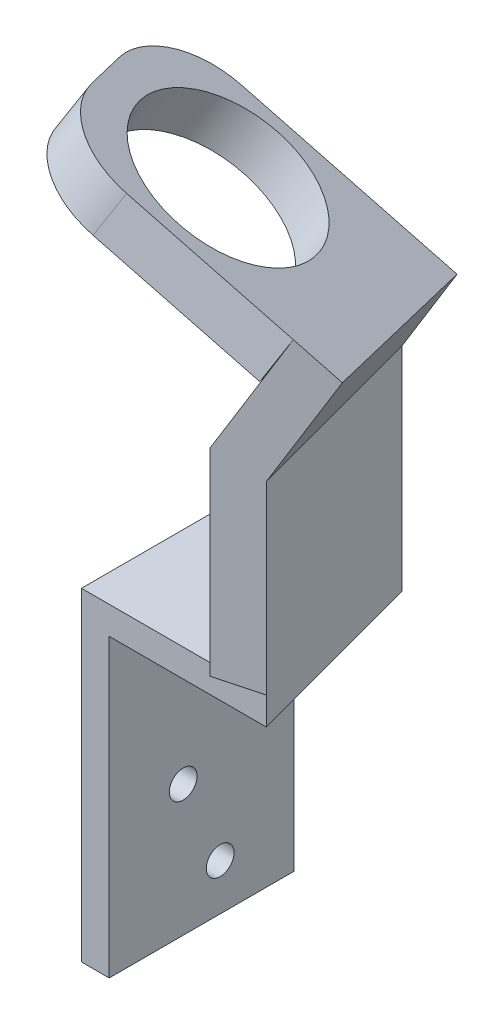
from build123d import *

# Parameters (mm, degrees)
EXTRUDE_3_DEPTH     = 20
SKETCH_6_R          = 1.5
CUT_EXTRUDE_3_DEPTH = 20
EXTRUDE_4_DEPTH     = 20
EXTRUDE_6_DEPTH     = 20.705523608
EXTRUDE_7_DEPTH     = 25
SKETCH_11_R         = 9
CUT_EXTRUDE_4_DEPTH = 22
CUT_EXTRUDE_5_DEPTH = 22
CUT_EXTRUDE_6_DEPTH = 22
FILLET_1_R          = 8


with BuildPart() as part:
    # Sketch 5 → Extrude 3 (new body)
    with BuildSketch(Plane.XY):
        Polygon((0, 0), (0, 35), (20, 35), (20, 32), (3, 32), (3, 0), align=None)
    extrude(amount=EXTRUDE_3_DEPTH)

    # Sketch 6 → Cut-Extrude 3 (cut)
    with BuildSketch(Plane.ZY):
        with Locations(Location((12, 14.16515139, 0), (0, 0, 270))):
            Circle(SKETCH_6_R)
        with Locations(Location((8, 5, 0), (0, 0, 270))):
            Circle(SKETCH_6_R)
    extrude(amount=-CUT_EXTRUDE_3_DEPTH, mode=Mode.SUBTRACT)

    # Sketch 7 → Extrude 4 (add)
    with BuildSketch(Plane(origin=(0, 35, 0), x_dir=(1, 0, 0), z_dir=(0, 1, 0))):
        Polygon((20, -20), (14.641016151, 0), (9.81138702, -1.294095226), (15.170370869, -21.294095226), align=None)
    extrude(amount=EXTRUDE_4_DEPTH)

    # Sketch 9 → Extrude 6 (add)
    with BuildSketch(Plane(origin=(6.339745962, 0, 23.660254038), x_dir=(0.965925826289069, 0, -0.2588190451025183), z_dir=(0.2588190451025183, 0, 0.965925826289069))):
        Polygon((14.142135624, 55), (26.642135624, 76.650635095), (22.312008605, 79.150635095), (9.142135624, 56.339745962), (9.142135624, 55), align=None)
    extrude(amount=-EXTRUDE_6_DEPTH)

    # Sketch 10 → Extrude 7 (add)
    with BuildSketch(Plane(origin=(-16.941589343, 10.126275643, 4.539485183), x_dir=(0.19239529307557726, -0.1149979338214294, 0.9745560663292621), z_dir=(-0.8365163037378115, 0.4999999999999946, 0.22414386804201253))):
        Polygon((15.232581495, 70.768416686), (-4.804781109, 64.40035665), (-3.290374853, 59.635215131), (16.746987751, 66.003275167), align=None)
    extrude(amount=EXTRUDE_7_DEPTH)

    # Sketch 11 → Cut-Extrude 4 (cut)
    with BuildSketch(Plane(origin=(27.060036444, 53.586276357, -18.546019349), x_dir=(0.9025036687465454, -0.4069958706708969, 0.14085982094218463), z_dir=(0.43068216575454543, 0.8528685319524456, -0.2951747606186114))):
        with Locations(Location((-20.809335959, -35.872633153, 0), (0, 0, 188.477948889))):
            Circle(SKETCH_11_R)
    extrude(amount=-CUT_EXTRUDE_4_DEPTH, mode=Mode.SUBTRACT)

    # Sketch 12 → Cut-Extrude 5 (cut)
    with BuildSketch(Plane(origin=(0, 35, 0), x_dir=(1, 0, 0), z_dir=(0, 1, 0))):
        Polygon((14.641016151, 0), (20, -20), (20, 0), align=None)
    extrude(amount=-CUT_EXTRUDE_5_DEPTH, mode=Mode.SUBTRACT)

    # Sketch 13 → Cut-Extrude 6 (cut)
    with BuildSketch(Plane(origin=(-16.941589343, 10.126275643, 4.539485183), x_dir=(0.19239529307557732, -0.11499793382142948, 0.974556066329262), z_dir=(-0.8365163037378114, 0.49999999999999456, 0.2241438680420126))):
        Polygon((-6.827728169, 79.499839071), (-4.804781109, 64.40035665), (15.232581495, 70.768416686), (13.694436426, 82.249287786), align=None)
    extrude(amount=-CUT_EXTRUDE_6_DEPTH, mode=Mode.SUBTRACT)

    # Fillet 1
    fillet_1_edges = [part.edges().sort_by_distance(p)[0] for p in [
        (0.307502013, 79.48690264, 25.726023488),
        (-6.814751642, 76.32509372, 6.198490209),
    ]]
    fillet(fillet_1_edges, radius=FILLET_1_R)


solid = part.part
